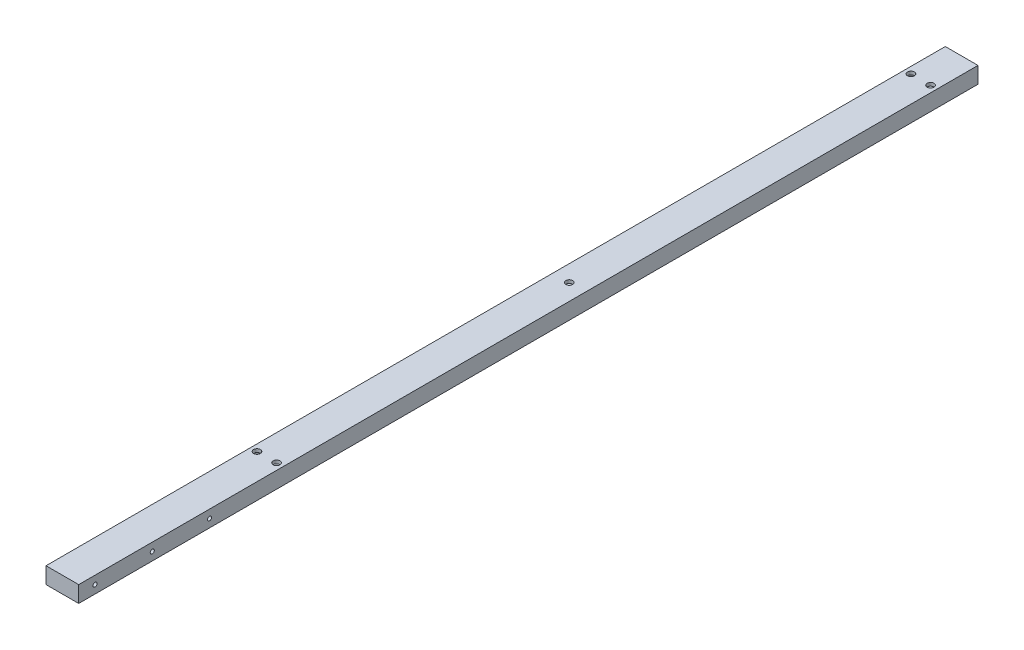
ISO-10303-21;
HEADER;
FILE_DESCRIPTION(('STEP AP214'),'2;1');
FILE_NAME('part.step','',(''),(''),'','','');
FILE_SCHEMA(('AUTOMOTIVE_DESIGN { 1 0 10303 214 1 1 1 1 }'));
ENDSEC;
DATA;
#1=APPLICATION_CONTEXT('core data for automotive mechanical design processes');
#2=APPLICATION_PROTOCOL_DEFINITION('international standard','automotive_design',2000,#1);
#3=PRODUCT_CONTEXT('',#1,'mechanical');
#4=PRODUCT('Part','Part','',(#3));
#5=PRODUCT_RELATED_PRODUCT_CATEGORY('part','',(#4));
#6=PRODUCT_DEFINITION_FORMATION('','',#4);
#7=PRODUCT_DEFINITION_CONTEXT('part definition',#1,'design');
#8=PRODUCT_DEFINITION('design','',#6,#7);
#9=PRODUCT_DEFINITION_SHAPE('','',#8);
#10=(LENGTH_UNIT() NAMED_UNIT(*) SI_UNIT(.MILLI.,.METRE.));
#11=(NAMED_UNIT(*) PLANE_ANGLE_UNIT() SI_UNIT($,.RADIAN.));
#12=(NAMED_UNIT(*) SI_UNIT($,.STERADIAN.) SOLID_ANGLE_UNIT());
#13=UNCERTAINTY_MEASURE_WITH_UNIT(LENGTH_MEASURE(1.E-05),#10,'distance_accuracy_value','');
#14=(GEOMETRIC_REPRESENTATION_CONTEXT(3) GLOBAL_UNCERTAINTY_ASSIGNED_CONTEXT((#13)) GLOBAL_UNIT_ASSIGNED_CONTEXT((#10,
#11,#12)) REPRESENTATION_CONTEXT('',''));
#15=CARTESIAN_POINT('',(0.,0.,0.));
#16=DIRECTION('',(0.,0.,1.));
#17=DIRECTION('',(1.,0.,0.));
#18=AXIS2_PLACEMENT_3D('',#15,#16,#17);
#19=CARTESIAN_POINT('',(-8.,3.,450.));
#20=DIRECTION('',(1.,0.,0.));
#21=DIRECTION('',(0.,0.,-1.));
#22=AXIS2_PLACEMENT_3D('',#19,#20,#21);
#23=PLANE('',#22);
#24=DIRECTION('',(0.,1.,0.));
#25=VECTOR('',#24,1.);
#26=CARTESIAN_POINT('',(-8.,5.,424.359687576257));
#27=LINE('',#26,#25);
#28=CARTESIAN_POINT('',(-8.,-3.,424.359687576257));
#29=VERTEX_POINT('',#28);
#30=CARTESIAN_POINT('',(-8.,3.,424.359687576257));
#31=VERTEX_POINT('',#30);
#32=EDGE_CURVE('E198',#29,#31,#27,.T.);
#33=ORIENTED_EDGE('',*,*,#32,.F.);
#34=DIRECTION('',(0.,0.,-1.));
#35=VECTOR('',#34,1.);
#36=CARTESIAN_POINT('',(-8.,-3.,450.));
#37=LINE('',#36,#35);
#38=CARTESIAN_POINT('',(-8.,-3.,25.6403124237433));
#39=VERTEX_POINT('',#38);
#40=EDGE_CURVE('E274',#29,#39,#37,.T.);
#41=ORIENTED_EDGE('',*,*,#40,.T.);
#42=DIRECTION('',(0.,1.,0.));
#43=VECTOR('',#42,1.);
#44=CARTESIAN_POINT('',(-8.,5.,25.6403124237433));
#45=LINE('',#44,#43);
#46=CARTESIAN_POINT('',(-8.,3.,25.6403124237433));
#47=VERTEX_POINT('',#46);
#48=EDGE_CURVE('E219',#47,#39,#45,.F.);
#49=ORIENTED_EDGE('',*,*,#48,.F.);
#50=DIRECTION('',(0.,0.,-1.));
#51=VECTOR('',#50,1.);
#52=CARTESIAN_POINT('',(-8.,3.,450.));
#53=LINE('',#52,#51);
#54=EDGE_CURVE('E279',#31,#47,#53,.T.);
#55=ORIENTED_EDGE('',*,*,#54,.F.);
#56=EDGE_LOOP('',(#33,#41,#49,#55));
#57=FACE_BOUND('',#56,.T.);
#58=ADVANCED_FACE('F35',(#57),#23,.T.);
#59=CARTESIAN_POINT('',(8.,3.,450.));
#60=DIRECTION('',(-1.,0.,0.));
#61=DIRECTION('',(0.,0.,1.));
#62=AXIS2_PLACEMENT_3D('',#59,#60,#61);
#63=PLANE('',#62);
#64=DIRECTION('',(0.,1.,0.));
#65=VECTOR('',#64,1.);
#66=CARTESIAN_POINT('',(8.,5.,425.640312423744));
#67=LINE('',#66,#65);
#68=CARTESIAN_POINT('',(8.,-3.,425.640312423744));
#69=VERTEX_POINT('',#68);
#70=CARTESIAN_POINT('',(8.,3.,425.640312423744));
#71=VERTEX_POINT('',#70);
#72=EDGE_CURVE('E209',#69,#71,#67,.T.);
#73=ORIENTED_EDGE('',*,*,#72,.F.);
#74=DIRECTION('',(0.,0.,-1.));
#75=VECTOR('',#74,1.);
#76=CARTESIAN_POINT('',(8.,-3.,450.));
#77=LINE('',#76,#75);
#78=CARTESIAN_POINT('',(8.,-3.,450.));
#79=VERTEX_POINT('',#78);
#80=EDGE_CURVE('E265',#79,#69,#77,.T.);
#81=ORIENTED_EDGE('',*,*,#80,.F.);
#82=DIRECTION('',(0.,1.,0.));
#83=VECTOR('',#82,1.);
#84=CARTESIAN_POINT('',(8.,3.,450.));
#85=LINE('',#84,#83);
#86=CARTESIAN_POINT('',(8.,3.,450.));
#87=VERTEX_POINT('',#86);
#88=EDGE_CURVE('E241',#79,#87,#85,.T.);
#89=ORIENTED_EDGE('',*,*,#88,.T.);
#90=DIRECTION('',(0.,0.,-1.));
#91=VECTOR('',#90,1.);
#92=CARTESIAN_POINT('',(8.,3.,450.));
#93=LINE('',#92,#91);
#94=EDGE_CURVE('E280',#87,#71,#93,.T.);
#95=ORIENTED_EDGE('',*,*,#94,.T.);
#96=EDGE_LOOP('',(#73,#81,#89,#95));
#97=FACE_BOUND('',#96,.T.);
#98=ADVANCED_FACE('F310',(#97),#63,.T.);
#99=DIRECTION('',(0.,1.,0.));
#100=VECTOR('',#99,1.);
#101=CARTESIAN_POINT('',(-8.,5.,24.3596875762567));
#102=LINE('',#101,#100);
#103=CARTESIAN_POINT('',(-8.,-3.,24.3596875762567));
#104=VERTEX_POINT('',#103);
#105=CARTESIAN_POINT('',(-8.,3.,24.3596875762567));
#106=VERTEX_POINT('',#105);
#107=EDGE_CURVE('E222',#104,#106,#102,.T.);
#108=ORIENTED_EDGE('',*,*,#107,.F.);
#109=CARTESIAN_POINT('',(-8.,-3.,0.));
#110=VERTEX_POINT('',#109);
#111=EDGE_CURVE('E268',#104,#110,#37,.T.);
#112=ORIENTED_EDGE('',*,*,#111,.T.);
#113=DIRECTION('',(0.,-1.,0.));
#114=VECTOR('',#113,1.);
#115=CARTESIAN_POINT('',(-8.,3.,0.));
#116=LINE('',#115,#114);
#117=CARTESIAN_POINT('',(-8.,3.,0.));
#118=VERTEX_POINT('',#117);
#119=EDGE_CURVE('E260',#118,#110,#116,.T.);
#120=ORIENTED_EDGE('',*,*,#119,.F.);
#121=EDGE_CURVE('E273',#106,#118,#53,.T.);
#122=ORIENTED_EDGE('',*,*,#121,.F.);
#123=EDGE_LOOP('',(#108,#112,#120,#122));
#124=FACE_BOUND('',#123,.T.);
#125=ADVANCED_FACE('F341',(#124),#23,.T.);
#126=DIRECTION('',(0.,1.,0.));
#127=VECTOR('',#126,1.);
#128=CARTESIAN_POINT('',(8.,5.,424.359687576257));
#129=LINE('',#128,#127);
#130=CARTESIAN_POINT('',(8.,3.,424.359687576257));
#131=VERTEX_POINT('',#130);
#132=CARTESIAN_POINT('',(8.,-3.,424.359687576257));
#133=VERTEX_POINT('',#132);
#134=EDGE_CURVE('E58',#131,#133,#129,.F.);
#135=ORIENTED_EDGE('',*,*,#134,.F.);
#136=CARTESIAN_POINT('',(8.,3.,25.6403124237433));
#137=VERTEX_POINT('',#136);
#138=EDGE_CURVE('E284',#131,#137,#93,.T.);
#139=ORIENTED_EDGE('',*,*,#138,.T.);
#140=DIRECTION('',(0.,1.,0.));
#141=VECTOR('',#140,1.);
#142=CARTESIAN_POINT('',(8.,5.,25.6403124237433));
#143=LINE('',#142,#141);
#144=CARTESIAN_POINT('',(8.,-3.,25.6403124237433));
#145=VERTEX_POINT('',#144);
#146=EDGE_CURVE('E237',#145,#137,#143,.T.);
#147=ORIENTED_EDGE('',*,*,#146,.F.);
#148=EDGE_CURVE('E269',#133,#145,#77,.T.);
#149=ORIENTED_EDGE('',*,*,#148,.F.);
#150=EDGE_LOOP('',(#135,#139,#147,#149));
#151=FACE_BOUND('',#150,.T.);
#152=ADVANCED_FACE('F323',(#151),#63,.T.);
#153=CARTESIAN_POINT('',(0.,0.,0.));
#154=DIRECTION('',(0.,0.,1.));
#155=DIRECTION('',(1.,0.,0.));
#156=AXIS2_PLACEMENT_3D('',#153,#154,#155);
#157=PLANE('',#156);
#158=DIRECTION('',(0.,1.,0.));
#159=VECTOR('',#158,1.);
#160=CARTESIAN_POINT('',(10.,5.,0.));
#161=LINE('',#160,#159);
#162=CARTESIAN_POINT('',(10.,-5.,0.));
#163=VERTEX_POINT('',#162);
#164=CARTESIAN_POINT('',(10.,5.,0.));
#165=VERTEX_POINT('',#164);
#166=EDGE_CURVE('E283',#163,#165,#161,.T.);
#167=ORIENTED_EDGE('',*,*,#166,.F.);
#168=DIRECTION('',(1.,0.,0.));
#169=VECTOR('',#168,1.);
#170=CARTESIAN_POINT('',(-10.,-5.,0.));
#171=LINE('',#170,#169);
#172=CARTESIAN_POINT('',(-10.,-5.,0.));
#173=VERTEX_POINT('',#172);
#174=EDGE_CURVE('E290',#173,#163,#171,.T.);
#175=ORIENTED_EDGE('',*,*,#174,.F.);
#176=DIRECTION('',(0.,-1.,0.));
#177=VECTOR('',#176,1.);
#178=CARTESIAN_POINT('',(-10.,5.,0.));
#179=LINE('',#178,#177);
#180=CARTESIAN_POINT('',(-10.,5.,0.));
#181=VERTEX_POINT('',#180);
#182=EDGE_CURVE('E288',#181,#173,#179,.T.);
#183=ORIENTED_EDGE('',*,*,#182,.F.);
#184=DIRECTION('',(-1.,0.,0.));
#185=VECTOR('',#184,1.);
#186=CARTESIAN_POINT('',(-10.,5.,0.));
#187=LINE('',#186,#185);
#188=EDGE_CURVE('E153',#165,#181,#187,.T.);
#189=ORIENTED_EDGE('',*,*,#188,.F.);
#190=EDGE_LOOP('',(#167,#175,#183,#189));
#191=FACE_BOUND('',#190,.T.);
#192=DIRECTION('',(0.,1.,0.));
#193=VECTOR('',#192,1.);
#194=CARTESIAN_POINT('',(8.,3.,0.));
#195=LINE('',#194,#193);
#196=CARTESIAN_POINT('',(8.,-3.,0.));
#197=VERTEX_POINT('',#196);
#198=CARTESIAN_POINT('',(8.,3.,0.));
#199=VERTEX_POINT('',#198);
#200=EDGE_CURVE('E240',#197,#199,#195,.T.);
#201=ORIENTED_EDGE('',*,*,#200,.T.);
#202=DIRECTION('',(-1.,0.,0.));
#203=VECTOR('',#202,1.);
#204=CARTESIAN_POINT('',(-8.,3.,0.));
#205=LINE('',#204,#203);
#206=EDGE_CURVE('E257',#199,#118,#205,.T.);
#207=ORIENTED_EDGE('',*,*,#206,.T.);
#208=ORIENTED_EDGE('',*,*,#119,.T.);
#209=DIRECTION('',(1.,0.,0.));
#210=VECTOR('',#209,1.);
#211=CARTESIAN_POINT('',(-8.,-3.,0.));
#212=LINE('',#211,#210);
#213=EDGE_CURVE('E245',#110,#197,#212,.T.);
#214=ORIENTED_EDGE('',*,*,#213,.T.);
#215=EDGE_LOOP('',(#201,#207,#208,#214));
#216=FACE_BOUND('',#215,.T.);
#217=ADVANCED_FACE('F336',(#191,#216),#157,.F.);
#218=CARTESIAN_POINT('',(10.,5.,450.));
#219=DIRECTION('',(-1.,0.,0.));
#220=DIRECTION('',(0.,-1.,0.));
#221=AXIS2_PLACEMENT_3D('',#218,#219,#220);
#222=PLANE('',#221);
#223=CARTESIAN_POINT('',(10.,0.,540.));
#224=DIRECTION('',(-1.,0.,0.));
#225=DIRECTION('',(0.,0.,1.));
#226=AXIS2_PLACEMENT_3D('',#223,#224,#225);
#227=CIRCLE('',#226,1.25);
#228=CARTESIAN_POINT('',(10.,0.,541.25));
#229=VERTEX_POINT('',#228);
#230=EDGE_CURVE('E447',#229,#229,#227,.T.);
#231=ORIENTED_EDGE('',*,*,#230,.T.);
#232=EDGE_LOOP('',(#231));
#233=FACE_BOUND('',#232,.T.);
#234=CARTESIAN_POINT('',(10.,0.,505.));
#235=DIRECTION('',(-1.,0.,0.));
#236=DIRECTION('',(0.,0.,1.));
#237=AXIS2_PLACEMENT_3D('',#234,#235,#236);
#238=CIRCLE('',#237,1.25);
#239=CARTESIAN_POINT('',(10.,0.,506.25));
#240=VERTEX_POINT('',#239);
#241=EDGE_CURVE('E457',#240,#240,#238,.T.);
#242=ORIENTED_EDGE('',*,*,#241,.T.);
#243=EDGE_LOOP('',(#242));
#244=FACE_BOUND('',#243,.T.);
#245=CARTESIAN_POINT('',(10.,0.,470.));
#246=DIRECTION('',(-1.,0.,0.));
#247=DIRECTION('',(0.,0.,1.));
#248=AXIS2_PLACEMENT_3D('',#245,#246,#247);
#249=CIRCLE('',#248,1.25);
#250=CARTESIAN_POINT('',(10.,0.,471.25));
#251=VERTEX_POINT('',#250);
#252=EDGE_CURVE('E172',#251,#251,#249,.T.);
#253=ORIENTED_EDGE('',*,*,#252,.T.);
#254=EDGE_LOOP('',(#253));
#255=FACE_BOUND('',#254,.T.);
#256=ORIENTED_EDGE('',*,*,#166,.T.);
#257=DIRECTION('',(0.,0.,-1.));
#258=VECTOR('',#257,1.);
#259=CARTESIAN_POINT('',(10.,5.,450.));
#260=LINE('',#259,#258);
#261=CARTESIAN_POINT('',(10.,5.,550.));
#262=VERTEX_POINT('',#261);
#263=EDGE_CURVE('E157',#262,#165,#260,.T.);
#264=ORIENTED_EDGE('',*,*,#263,.F.);
#265=DIRECTION('',(0.,-1.,0.));
#266=VECTOR('',#265,1.);
#267=CARTESIAN_POINT('',(10.,5.,550.));
#268=LINE('',#267,#266);
#269=CARTESIAN_POINT('',(10.,-5.,550.));
#270=VERTEX_POINT('',#269);
#271=EDGE_CURVE('E168',#262,#270,#268,.T.);
#272=ORIENTED_EDGE('',*,*,#271,.T.);
#273=DIRECTION('',(0.,0.,-1.));
#274=VECTOR('',#273,1.);
#275=CARTESIAN_POINT('',(10.,-5.,450.));
#276=LINE('',#275,#274);
#277=EDGE_CURVE('E292',#270,#163,#276,.T.);
#278=ORIENTED_EDGE('',*,*,#277,.T.);
#279=EDGE_LOOP('',(#256,#264,#272,#278));
#280=FACE_BOUND('',#279,.T.);
#281=ADVANCED_FACE('F37',(#233,#244,#255,#280),#222,.F.);
#282=CARTESIAN_POINT('',(-10.,5.,450.));
#283=DIRECTION('',(0.,-1.,0.));
#284=DIRECTION('',(0.,0.,-1.));
#285=AXIS2_PLACEMENT_3D('',#282,#283,#284);
#286=PLANE('',#285);
#287=CARTESIAN_POINT('',(0.,5.,240.));
#288=DIRECTION('',(0.,-1.,0.));
#289=DIRECTION('',(0.,0.,-1.));
#290=AXIS2_PLACEMENT_3D('',#287,#288,#289);
#291=CIRCLE('',#290,2.1);
#292=CARTESIAN_POINT('',(0.,5.,237.9));
#293=VERTEX_POINT('',#292);
#294=EDGE_CURVE('E185',#293,#293,#291,.T.);
#295=ORIENTED_EDGE('',*,*,#294,.T.);
#296=EDGE_LOOP('',(#295));
#297=FACE_BOUND('',#296,.T.);
#298=CARTESIAN_POINT('',(-5.99999999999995,5.,425.));
#299=DIRECTION('',(0.,1.,0.));
#300=DIRECTION('',(0.,0.,1.));
#301=AXIS2_PLACEMENT_3D('',#298,#299,#300);
#302=CIRCLE('',#301,2.1);
#303=CARTESIAN_POINT('',(-5.99999999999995,5.,427.1));
#304=VERTEX_POINT('',#303);
#305=EDGE_CURVE('E191',#304,#304,#302,.T.);
#306=ORIENTED_EDGE('',*,*,#305,.F.);
#307=EDGE_LOOP('',(#306));
#308=FACE_BOUND('',#307,.T.);
#309=CARTESIAN_POINT('',(6.00000000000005,5.,425.));
#310=DIRECTION('',(0.,1.,0.));
#311=DIRECTION('',(0.,0.,1.));
#312=AXIS2_PLACEMENT_3D('',#309,#310,#311);
#313=CIRCLE('',#312,2.1);
#314=CARTESIAN_POINT('',(6.00000000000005,5.,427.1));
#315=VERTEX_POINT('',#314);
#316=EDGE_CURVE('E202',#315,#315,#313,.T.);
#317=ORIENTED_EDGE('',*,*,#316,.F.);
#318=EDGE_LOOP('',(#317));
#319=FACE_BOUND('',#318,.T.);
#320=CARTESIAN_POINT('',(-6.,5.,25.));
#321=DIRECTION('',(0.,1.,0.));
#322=DIRECTION('',(0.,0.,1.));
#323=AXIS2_PLACEMENT_3D('',#320,#321,#322);
#324=CIRCLE('',#323,2.1);
#325=CARTESIAN_POINT('',(-6.,5.,27.1));
#326=VERTEX_POINT('',#325);
#327=EDGE_CURVE('E213',#326,#326,#324,.T.);
#328=ORIENTED_EDGE('',*,*,#327,.F.);
#329=EDGE_LOOP('',(#328));
#330=FACE_BOUND('',#329,.T.);
#331=CARTESIAN_POINT('',(6.,5.,25.));
#332=DIRECTION('',(0.,1.,0.));
#333=DIRECTION('',(0.,0.,1.));
#334=AXIS2_PLACEMENT_3D('',#331,#332,#333);
#335=CIRCLE('',#334,2.1);
#336=CARTESIAN_POINT('',(6.,5.,27.1));
#337=VERTEX_POINT('',#336);
#338=EDGE_CURVE('E227',#337,#337,#335,.T.);
#339=ORIENTED_EDGE('',*,*,#338,.F.);
#340=EDGE_LOOP('',(#339));
#341=FACE_BOUND('',#340,.T.);
#342=ORIENTED_EDGE('',*,*,#188,.T.);
#343=DIRECTION('',(0.,0.,-1.));
#344=VECTOR('',#343,1.);
#345=CARTESIAN_POINT('',(-10.,5.,450.));
#346=LINE('',#345,#344);
#347=CARTESIAN_POINT('',(-10.,5.,550.));
#348=VERTEX_POINT('',#347);
#349=EDGE_CURVE('E148',#348,#181,#346,.T.);
#350=ORIENTED_EDGE('',*,*,#349,.F.);
#351=DIRECTION('',(1.,0.,0.));
#352=VECTOR('',#351,1.);
#353=CARTESIAN_POINT('',(10.,5.,550.));
#354=LINE('',#353,#352);
#355=EDGE_CURVE('E152',#348,#262,#354,.T.);
#356=ORIENTED_EDGE('',*,*,#355,.T.);
#357=ORIENTED_EDGE('',*,*,#263,.T.);
#358=EDGE_LOOP('',(#342,#350,#356,#357));
#359=FACE_BOUND('',#358,.T.);
#360=ADVANCED_FACE('F150',(#297,#308,#319,#330,#341,#359),#286,.F.);
#361=CARTESIAN_POINT('',(-10.,5.,450.));
#362=DIRECTION('',(1.,0.,0.));
#363=DIRECTION('',(0.,0.,-1.));
#364=AXIS2_PLACEMENT_3D('',#361,#362,#363);
#365=PLANE('',#364);
#366=CARTESIAN_POINT('',(-10.,0.,540.));
#367=DIRECTION('',(-1.,0.,0.));
#368=DIRECTION('',(0.,0.,1.));
#369=AXIS2_PLACEMENT_3D('',#366,#367,#368);
#370=CIRCLE('',#369,1.24999999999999);
#371=CARTESIAN_POINT('',(-10.,0.,541.25));
#372=VERTEX_POINT('',#371);
#373=EDGE_CURVE('E450',#372,#372,#370,.T.);
#374=ORIENTED_EDGE('',*,*,#373,.F.);
#375=EDGE_LOOP('',(#374));
#376=FACE_BOUND('',#375,.T.);
#377=CARTESIAN_POINT('',(-10.,0.,505.));
#378=DIRECTION('',(-1.,0.,0.));
#379=DIRECTION('',(0.,0.,1.));
#380=AXIS2_PLACEMENT_3D('',#377,#378,#379);
#381=CIRCLE('',#380,1.24999999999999);
#382=CARTESIAN_POINT('',(-10.,0.,506.25));
#383=VERTEX_POINT('',#382);
#384=EDGE_CURVE('E452',#383,#383,#381,.T.);
#385=ORIENTED_EDGE('',*,*,#384,.F.);
#386=EDGE_LOOP('',(#385));
#387=FACE_BOUND('',#386,.T.);
#388=CARTESIAN_POINT('',(-10.,0.,470.));
#389=DIRECTION('',(-1.,0.,0.));
#390=DIRECTION('',(0.,0.,1.));
#391=AXIS2_PLACEMENT_3D('',#388,#389,#390);
#392=CIRCLE('',#391,1.24999999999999);
#393=CARTESIAN_POINT('',(-10.,0.,471.25));
#394=VERTEX_POINT('',#393);
#395=EDGE_CURVE('E175',#394,#394,#392,.T.);
#396=ORIENTED_EDGE('',*,*,#395,.F.);
#397=EDGE_LOOP('',(#396));
#398=FACE_BOUND('',#397,.T.);
#399=ORIENTED_EDGE('',*,*,#182,.T.);
#400=DIRECTION('',(0.,0.,-1.));
#401=VECTOR('',#400,1.);
#402=CARTESIAN_POINT('',(-10.,-5.,450.));
#403=LINE('',#402,#401);
#404=CARTESIAN_POINT('',(-10.,-5.,550.));
#405=VERTEX_POINT('',#404);
#406=EDGE_CURVE('E158',#405,#173,#403,.T.);
#407=ORIENTED_EDGE('',*,*,#406,.F.);
#408=DIRECTION('',(0.,1.,0.));
#409=VECTOR('',#408,1.);
#410=CARTESIAN_POINT('',(-10.,5.,550.));
#411=LINE('',#410,#409);
#412=EDGE_CURVE('E165',#405,#348,#411,.T.);
#413=ORIENTED_EDGE('',*,*,#412,.T.);
#414=ORIENTED_EDGE('',*,*,#349,.T.);
#415=EDGE_LOOP('',(#399,#407,#413,#414));
#416=FACE_BOUND('',#415,.T.);
#417=ADVANCED_FACE('F170',(#376,#387,#398,#416),#365,.F.);
#418=CARTESIAN_POINT('',(-10.,-5.,450.));
#419=DIRECTION('',(0.,1.,0.));
#420=DIRECTION('',(0.,0.,1.));
#421=AXIS2_PLACEMENT_3D('',#418,#419,#420);
#422=PLANE('',#421);
#423=CARTESIAN_POINT('',(0.,-5.,240.));
#424=DIRECTION('',(0.,-1.,0.));
#425=DIRECTION('',(0.,0.,-1.));
#426=AXIS2_PLACEMENT_3D('',#423,#424,#425);
#427=CIRCLE('',#426,2.09999999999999);
#428=CARTESIAN_POINT('',(0.,-5.,237.9));
#429=VERTEX_POINT('',#428);
#430=EDGE_CURVE('E182',#429,#429,#427,.T.);
#431=ORIENTED_EDGE('',*,*,#430,.F.);
#432=EDGE_LOOP('',(#431));
#433=FACE_BOUND('',#432,.T.);
#434=CARTESIAN_POINT('',(-5.99999999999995,-5.,425.));
#435=DIRECTION('',(0.,1.,0.));
#436=DIRECTION('',(0.,0.,1.));
#437=AXIS2_PLACEMENT_3D('',#434,#435,#436);
#438=CIRCLE('',#437,2.1);
#439=CARTESIAN_POINT('',(-5.99999999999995,-5.,427.1));
#440=VERTEX_POINT('',#439);
#441=EDGE_CURVE('E194',#440,#440,#438,.T.);
#442=ORIENTED_EDGE('',*,*,#441,.T.);
#443=EDGE_LOOP('',(#442));
#444=FACE_BOUND('',#443,.T.);
#445=CARTESIAN_POINT('',(6.00000000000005,-5.,425.));
#446=DIRECTION('',(0.,1.,0.));
#447=DIRECTION('',(0.,0.,1.));
#448=AXIS2_PLACEMENT_3D('',#445,#446,#447);
#449=CIRCLE('',#448,2.1);
#450=CARTESIAN_POINT('',(6.00000000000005,-5.,427.1));
#451=VERTEX_POINT('',#450);
#452=EDGE_CURVE('E205',#451,#451,#449,.T.);
#453=ORIENTED_EDGE('',*,*,#452,.T.);
#454=EDGE_LOOP('',(#453));
#455=FACE_BOUND('',#454,.T.);
#456=CARTESIAN_POINT('',(-6.,-5.,25.));
#457=DIRECTION('',(0.,1.,0.));
#458=DIRECTION('',(0.,0.,1.));
#459=AXIS2_PLACEMENT_3D('',#456,#457,#458);
#460=CIRCLE('',#459,2.1);
#461=CARTESIAN_POINT('',(-6.,-5.,27.1));
#462=VERTEX_POINT('',#461);
#463=EDGE_CURVE('E216',#462,#462,#460,.T.);
#464=ORIENTED_EDGE('',*,*,#463,.T.);
#465=EDGE_LOOP('',(#464));
#466=FACE_BOUND('',#465,.T.);
#467=CARTESIAN_POINT('',(6.,-5.,25.));
#468=DIRECTION('',(0.,1.,0.));
#469=DIRECTION('',(0.,0.,1.));
#470=AXIS2_PLACEMENT_3D('',#467,#468,#469);
#471=CIRCLE('',#470,2.1);
#472=CARTESIAN_POINT('',(6.,-5.,27.1));
#473=VERTEX_POINT('',#472);
#474=EDGE_CURVE('E230',#473,#473,#471,.T.);
#475=ORIENTED_EDGE('',*,*,#474,.T.);
#476=EDGE_LOOP('',(#475));
#477=FACE_BOUND('',#476,.T.);
#478=ORIENTED_EDGE('',*,*,#174,.T.);
#479=ORIENTED_EDGE('',*,*,#277,.F.);
#480=DIRECTION('',(-1.,0.,0.));
#481=VECTOR('',#480,1.);
#482=CARTESIAN_POINT('',(10.,-5.,550.));
#483=LINE('',#482,#481);
#484=EDGE_CURVE('E180',#270,#405,#483,.T.);
#485=ORIENTED_EDGE('',*,*,#484,.T.);
#486=ORIENTED_EDGE('',*,*,#406,.T.);
#487=EDGE_LOOP('',(#478,#479,#485,#486));
#488=FACE_BOUND('',#487,.T.);
#489=ADVANCED_FACE('F380',(#433,#444,#455,#466,#477,#488),#422,.F.);
#490=DIRECTION('',(0.,1.,0.));
#491=VECTOR('',#490,1.);
#492=CARTESIAN_POINT('',(8.,5.,24.3596875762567));
#493=LINE('',#492,#491);
#494=CARTESIAN_POINT('',(8.,3.,24.3596875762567));
#495=VERTEX_POINT('',#494);
#496=CARTESIAN_POINT('',(8.,-3.,24.3596875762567));
#497=VERTEX_POINT('',#496);
#498=EDGE_CURVE('E233',#495,#497,#493,.F.);
#499=ORIENTED_EDGE('',*,*,#498,.F.);
#500=EDGE_CURVE('E278',#495,#199,#93,.T.);
#501=ORIENTED_EDGE('',*,*,#500,.T.);
#502=ORIENTED_EDGE('',*,*,#200,.F.);
#503=EDGE_CURVE('E254',#497,#197,#77,.T.);
#504=ORIENTED_EDGE('',*,*,#503,.F.);
#505=EDGE_LOOP('',(#499,#501,#502,#504));
#506=FACE_BOUND('',#505,.T.);
#507=ADVANCED_FACE('F332',(#506),#63,.T.);
#508=CARTESIAN_POINT('',(-8.,3.,450.));
#509=DIRECTION('',(0.,-1.,0.));
#510=DIRECTION('',(0.,0.,-1.));
#511=AXIS2_PLACEMENT_3D('',#508,#509,#510);
#512=PLANE('',#511);
#513=CARTESIAN_POINT('',(0.,3.,240.));
#514=DIRECTION('',(0.,-1.,0.));
#515=DIRECTION('',(0.,0.,-1.));
#516=AXIS2_PLACEMENT_3D('',#513,#514,#515);
#517=CIRCLE('',#516,2.09999999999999);
#518=CARTESIAN_POINT('',(0.,3.,237.9));
#519=VERTEX_POINT('',#518);
#520=EDGE_CURVE('E188',#519,#519,#517,.T.);
#521=ORIENTED_EDGE('',*,*,#520,.F.);
#522=EDGE_LOOP('',(#521));
#523=FACE_BOUND('',#522,.T.);
#524=CARTESIAN_POINT('',(-5.99999999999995,3.,425.));
#525=DIRECTION('',(0.,-1.,0.));
#526=DIRECTION('',(0.,0.,-1.));
#527=AXIS2_PLACEMENT_3D('',#524,#525,#526);
#528=CIRCLE('',#527,2.1);
#529=CARTESIAN_POINT('',(-8.,3.,425.640312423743));
#530=VERTEX_POINT('',#529);
#531=EDGE_CURVE('E200',#31,#530,#528,.T.);
#532=ORIENTED_EDGE('',*,*,#531,.F.);
#533=ORIENTED_EDGE('',*,*,#54,.T.);
#534=CARTESIAN_POINT('',(-6.,3.,25.));
#535=DIRECTION('',(0.,-1.,0.));
#536=DIRECTION('',(0.,0.,-1.));
#537=AXIS2_PLACEMENT_3D('',#534,#535,#536);
#538=CIRCLE('',#537,2.1);
#539=EDGE_CURVE('E224',#106,#47,#538,.T.);
#540=ORIENTED_EDGE('',*,*,#539,.F.);
#541=ORIENTED_EDGE('',*,*,#121,.T.);
#542=ORIENTED_EDGE('',*,*,#206,.F.);
#543=ORIENTED_EDGE('',*,*,#500,.F.);
#544=CARTESIAN_POINT('',(6.,3.,25.));
#545=DIRECTION('',(0.,-1.,0.));
#546=DIRECTION('',(0.,0.,-1.));
#547=AXIS2_PLACEMENT_3D('',#544,#545,#546);
#548=CIRCLE('',#547,2.1);
#549=EDGE_CURVE('E235',#137,#495,#548,.T.);
#550=ORIENTED_EDGE('',*,*,#549,.F.);
#551=ORIENTED_EDGE('',*,*,#138,.F.);
#552=CARTESIAN_POINT('',(6.00000000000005,3.,425.));
#553=DIRECTION('',(0.,-1.,0.));
#554=DIRECTION('',(0.,0.,-1.));
#555=AXIS2_PLACEMENT_3D('',#552,#553,#554);
#556=CIRCLE('',#555,2.1);
#557=EDGE_CURVE('E211',#71,#131,#556,.T.);
#558=ORIENTED_EDGE('',*,*,#557,.F.);
#559=ORIENTED_EDGE('',*,*,#94,.F.);
#560=DIRECTION('',(-1.,0.,0.));
#561=VECTOR('',#560,1.);
#562=CARTESIAN_POINT('',(-8.,3.,450.));
#563=LINE('',#562,#561);
#564=CARTESIAN_POINT('',(-8.,3.,450.));
#565=VERTEX_POINT('',#564);
#566=EDGE_CURVE('E244',#87,#565,#563,.T.);
#567=ORIENTED_EDGE('',*,*,#566,.T.);
#568=EDGE_CURVE('E275',#565,#530,#53,.T.);
#569=ORIENTED_EDGE('',*,*,#568,.T.);
#570=EDGE_LOOP('',(#532,#533,#540,#541,#542,#543,#550,#551,#558,#559,#567,#569));
#571=FACE_BOUND('',#570,.T.);
#572=ADVANCED_FACE('F318',(#523,#571),#512,.T.);
#573=DIRECTION('',(0.,1.,0.));
#574=VECTOR('',#573,1.);
#575=CARTESIAN_POINT('',(-8.,5.,425.640312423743));
#576=LINE('',#575,#574);
#577=CARTESIAN_POINT('',(-8.,-3.,425.640312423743));
#578=VERTEX_POINT('',#577);
#579=EDGE_CURVE('E50',#530,#578,#576,.F.);
#580=ORIENTED_EDGE('',*,*,#579,.F.);
#581=ORIENTED_EDGE('',*,*,#568,.F.);
#582=DIRECTION('',(0.,-1.,0.));
#583=VECTOR('',#582,1.);
#584=CARTESIAN_POINT('',(-8.,3.,450.));
#585=LINE('',#584,#583);
#586=CARTESIAN_POINT('',(-8.,-3.,450.));
#587=VERTEX_POINT('',#586);
#588=EDGE_CURVE('E248',#565,#587,#585,.T.);
#589=ORIENTED_EDGE('',*,*,#588,.T.);
#590=EDGE_CURVE('E270',#587,#578,#37,.T.);
#591=ORIENTED_EDGE('',*,*,#590,.T.);
#592=EDGE_LOOP('',(#580,#581,#589,#591));
#593=FACE_BOUND('',#592,.T.);
#594=ADVANCED_FACE('F355',(#593),#23,.T.);
#595=CARTESIAN_POINT('',(-8.,-3.,450.));
#596=DIRECTION('',(0.,1.,0.));
#597=DIRECTION('',(0.,0.,1.));
#598=AXIS2_PLACEMENT_3D('',#595,#596,#597);
#599=PLANE('',#598);
#600=CARTESIAN_POINT('',(0.,-3.,240.));
#601=DIRECTION('',(0.,1.,0.));
#602=DIRECTION('',(0.,0.,1.));
#603=AXIS2_PLACEMENT_3D('',#600,#601,#602);
#604=CIRCLE('',#603,2.09999999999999);
#605=CARTESIAN_POINT('',(0.,-3.,242.1));
#606=VERTEX_POINT('',#605);
#607=EDGE_CURVE('E39',#606,#606,#604,.T.);
#608=ORIENTED_EDGE('',*,*,#607,.F.);
#609=EDGE_LOOP('',(#608));
#610=FACE_BOUND('',#609,.T.);
#611=CARTESIAN_POINT('',(-5.99999999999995,-3.,425.));
#612=DIRECTION('',(0.,1.,0.));
#613=DIRECTION('',(0.,0.,1.));
#614=AXIS2_PLACEMENT_3D('',#611,#612,#613);
#615=CIRCLE('',#614,2.1);
#616=EDGE_CURVE('E11',#578,#29,#615,.T.);
#617=ORIENTED_EDGE('',*,*,#616,.F.);
#618=ORIENTED_EDGE('',*,*,#590,.F.);
#619=DIRECTION('',(1.,0.,0.));
#620=VECTOR('',#619,1.);
#621=CARTESIAN_POINT('',(-8.,-3.,450.));
#622=LINE('',#621,#620);
#623=EDGE_CURVE('E251',#587,#79,#622,.T.);
#624=ORIENTED_EDGE('',*,*,#623,.T.);
#625=ORIENTED_EDGE('',*,*,#80,.T.);
#626=CARTESIAN_POINT('',(6.00000000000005,-3.,425.));
#627=DIRECTION('',(0.,1.,0.));
#628=DIRECTION('',(0.,0.,1.));
#629=AXIS2_PLACEMENT_3D('',#626,#627,#628);
#630=CIRCLE('',#629,2.1);
#631=EDGE_CURVE('E44',#133,#69,#630,.T.);
#632=ORIENTED_EDGE('',*,*,#631,.F.);
#633=ORIENTED_EDGE('',*,*,#148,.T.);
#634=CARTESIAN_POINT('',(6.,-3.,25.));
#635=DIRECTION('',(0.,1.,0.));
#636=DIRECTION('',(0.,0.,1.));
#637=AXIS2_PLACEMENT_3D('',#634,#635,#636);
#638=CIRCLE('',#637,2.1);
#639=EDGE_CURVE('E297',#497,#145,#638,.T.);
#640=ORIENTED_EDGE('',*,*,#639,.F.);
#641=ORIENTED_EDGE('',*,*,#503,.T.);
#642=ORIENTED_EDGE('',*,*,#213,.F.);
#643=ORIENTED_EDGE('',*,*,#111,.F.);
#644=CARTESIAN_POINT('',(-6.,-3.,25.));
#645=DIRECTION('',(0.,1.,0.));
#646=DIRECTION('',(0.,0.,1.));
#647=AXIS2_PLACEMENT_3D('',#644,#645,#646);
#648=CIRCLE('',#647,2.1);
#649=EDGE_CURVE('E300',#39,#104,#648,.T.);
#650=ORIENTED_EDGE('',*,*,#649,.F.);
#651=ORIENTED_EDGE('',*,*,#40,.F.);
#652=EDGE_LOOP('',(#617,#618,#624,#625,#632,#633,#640,#641,#642,#643,#650,#651));
#653=FACE_BOUND('',#652,.T.);
#654=ADVANCED_FACE('F312',(#610,#653),#599,.T.);
#655=CARTESIAN_POINT('',(6.,5.,25.));
#656=DIRECTION('',(0.,1.,0.));
#657=DIRECTION('',(0.,0.,1.));
#658=AXIS2_PLACEMENT_3D('',#655,#656,#657);
#659=CYLINDRICAL_SURFACE('',#658,2.1);
#660=ORIENTED_EDGE('',*,*,#146,.T.);
#661=ORIENTED_EDGE('',*,*,#549,.T.);
#662=ORIENTED_EDGE('',*,*,#498,.T.);
#663=ORIENTED_EDGE('',*,*,#639,.T.);
#664=EDGE_LOOP('',(#660,#661,#662,#663));
#665=FACE_BOUND('',#664,.T.);
#666=ORIENTED_EDGE('',*,*,#474,.F.);
#667=EDGE_LOOP('',(#666));
#668=FACE_BOUND('',#667,.T.);
#669=ORIENTED_EDGE('',*,*,#338,.T.);
#670=EDGE_LOOP('',(#669));
#671=FACE_BOUND('',#670,.T.);
#672=ADVANCED_FACE('F362',(#665,#668,#671),#659,.F.);
#673=CARTESIAN_POINT('',(-6.,5.,25.));
#674=DIRECTION('',(0.,1.,0.));
#675=DIRECTION('',(0.,0.,1.));
#676=AXIS2_PLACEMENT_3D('',#673,#674,#675);
#677=CYLINDRICAL_SURFACE('',#676,2.1);
#678=ORIENTED_EDGE('',*,*,#539,.T.);
#679=ORIENTED_EDGE('',*,*,#48,.T.);
#680=ORIENTED_EDGE('',*,*,#649,.T.);
#681=ORIENTED_EDGE('',*,*,#107,.T.);
#682=EDGE_LOOP('',(#678,#679,#680,#681));
#683=FACE_BOUND('',#682,.T.);
#684=ORIENTED_EDGE('',*,*,#463,.F.);
#685=EDGE_LOOP('',(#684));
#686=FACE_BOUND('',#685,.T.);
#687=ORIENTED_EDGE('',*,*,#327,.T.);
#688=EDGE_LOOP('',(#687));
#689=FACE_BOUND('',#688,.T.);
#690=ADVANCED_FACE('F349',(#683,#686,#689),#677,.F.);
#691=CARTESIAN_POINT('',(6.00000000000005,5.,425.));
#692=DIRECTION('',(0.,1.,0.));
#693=DIRECTION('',(0.,0.,1.));
#694=AXIS2_PLACEMENT_3D('',#691,#692,#693);
#695=CYLINDRICAL_SURFACE('',#694,2.1);
#696=ORIENTED_EDGE('',*,*,#557,.T.);
#697=ORIENTED_EDGE('',*,*,#134,.T.);
#698=ORIENTED_EDGE('',*,*,#631,.T.);
#699=ORIENTED_EDGE('',*,*,#72,.T.);
#700=EDGE_LOOP('',(#696,#697,#698,#699));
#701=FACE_BOUND('',#700,.T.);
#702=ORIENTED_EDGE('',*,*,#452,.F.);
#703=EDGE_LOOP('',(#702));
#704=FACE_BOUND('',#703,.T.);
#705=ORIENTED_EDGE('',*,*,#316,.T.);
#706=EDGE_LOOP('',(#705));
#707=FACE_BOUND('',#706,.T.);
#708=ADVANCED_FACE('F303',(#701,#704,#707),#695,.F.);
#709=CARTESIAN_POINT('',(-5.99999999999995,5.,425.));
#710=DIRECTION('',(0.,1.,0.));
#711=DIRECTION('',(0.,0.,1.));
#712=AXIS2_PLACEMENT_3D('',#709,#710,#711);
#713=CYLINDRICAL_SURFACE('',#712,2.1);
#714=ORIENTED_EDGE('',*,*,#531,.T.);
#715=ORIENTED_EDGE('',*,*,#579,.T.);
#716=ORIENTED_EDGE('',*,*,#616,.T.);
#717=ORIENTED_EDGE('',*,*,#32,.T.);
#718=EDGE_LOOP('',(#714,#715,#716,#717));
#719=FACE_BOUND('',#718,.T.);
#720=ORIENTED_EDGE('',*,*,#441,.F.);
#721=EDGE_LOOP('',(#720));
#722=FACE_BOUND('',#721,.T.);
#723=ORIENTED_EDGE('',*,*,#305,.T.);
#724=EDGE_LOOP('',(#723));
#725=FACE_BOUND('',#724,.T.);
#726=ADVANCED_FACE('F352',(#719,#722,#725),#713,.F.);
#727=CARTESIAN_POINT('',(0.,-5.,240.));
#728=DIRECTION('',(0.,-1.,0.));
#729=DIRECTION('',(0.,0.,-1.));
#730=AXIS2_PLACEMENT_3D('',#727,#728,#729);
#731=CYLINDRICAL_SURFACE('',#730,2.09999999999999);
#732=ORIENTED_EDGE('',*,*,#607,.T.);
#733=EDGE_LOOP('',(#732));
#734=FACE_BOUND('',#733,.T.);
#735=ORIENTED_EDGE('',*,*,#430,.T.);
#736=EDGE_LOOP('',(#735));
#737=FACE_BOUND('',#736,.T.);
#738=ADVANCED_FACE('F423',(#734,#737),#731,.F.);
#739=ORIENTED_EDGE('',*,*,#520,.T.);
#740=EDGE_LOOP('',(#739));
#741=FACE_BOUND('',#740,.T.);
#742=ORIENTED_EDGE('',*,*,#294,.F.);
#743=EDGE_LOOP('',(#742));
#744=FACE_BOUND('',#743,.T.);
#745=ADVANCED_FACE('F426',(#741,#744),#731,.F.);
#746=CARTESIAN_POINT('',(0.,0.,450.));
#747=DIRECTION('',(0.,0.,-1.));
#748=DIRECTION('',(-1.,0.,0.));
#749=AXIS2_PLACEMENT_3D('',#746,#747,#748);
#750=PLANE('',#749);
#751=ORIENTED_EDGE('',*,*,#566,.F.);
#752=ORIENTED_EDGE('',*,*,#88,.F.);
#753=ORIENTED_EDGE('',*,*,#623,.F.);
#754=ORIENTED_EDGE('',*,*,#588,.F.);
#755=EDGE_LOOP('',(#751,#752,#753,#754));
#756=FACE_BOUND('',#755,.T.);
#757=ADVANCED_FACE('F315',(#756),#750,.T.);
#758=CARTESIAN_POINT('',(0.,0.,550.));
#759=DIRECTION('',(0.,0.,-1.));
#760=DIRECTION('',(-1.,0.,0.));
#761=AXIS2_PLACEMENT_3D('',#758,#759,#760);
#762=PLANE('',#761);
#763=ORIENTED_EDGE('',*,*,#412,.F.);
#764=ORIENTED_EDGE('',*,*,#484,.F.);
#765=ORIENTED_EDGE('',*,*,#271,.F.);
#766=ORIENTED_EDGE('',*,*,#355,.F.);
#767=EDGE_LOOP('',(#763,#764,#765,#766));
#768=FACE_BOUND('',#767,.T.);
#769=ADVANCED_FACE('F163',(#768),#762,.F.);
#770=CARTESIAN_POINT('',(-10.,0.,470.));
#771=DIRECTION('',(-1.,0.,0.));
#772=DIRECTION('',(0.,0.,1.));
#773=AXIS2_PLACEMENT_3D('',#770,#771,#772);
#774=CYLINDRICAL_SURFACE('',#773,1.24999999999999);
#775=ORIENTED_EDGE('',*,*,#252,.F.);
#776=EDGE_LOOP('',(#775));
#777=FACE_BOUND('',#776,.T.);
#778=ORIENTED_EDGE('',*,*,#395,.T.);
#779=EDGE_LOOP('',(#778));
#780=FACE_BOUND('',#779,.T.);
#781=ADVANCED_FACE('F431',(#777,#780),#774,.F.);
#782=CARTESIAN_POINT('',(-10.,0.,505.));
#783=DIRECTION('',(-1.,0.,0.));
#784=DIRECTION('',(0.,0.,1.));
#785=AXIS2_PLACEMENT_3D('',#782,#783,#784);
#786=CYLINDRICAL_SURFACE('',#785,1.24999999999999);
#787=ORIENTED_EDGE('',*,*,#241,.F.);
#788=EDGE_LOOP('',(#787));
#789=FACE_BOUND('',#788,.T.);
#790=ORIENTED_EDGE('',*,*,#384,.T.);
#791=EDGE_LOOP('',(#790));
#792=FACE_BOUND('',#791,.T.);
#793=ADVANCED_FACE('F434',(#789,#792),#786,.F.);
#794=CARTESIAN_POINT('',(-10.,0.,540.));
#795=DIRECTION('',(-1.,0.,0.));
#796=DIRECTION('',(0.,0.,1.));
#797=AXIS2_PLACEMENT_3D('',#794,#795,#796);
#798=CYLINDRICAL_SURFACE('',#797,1.24999999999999);
#799=ORIENTED_EDGE('',*,*,#230,.F.);
#800=EDGE_LOOP('',(#799));
#801=FACE_BOUND('',#800,.T.);
#802=ORIENTED_EDGE('',*,*,#373,.T.);
#803=EDGE_LOOP('',(#802));
#804=FACE_BOUND('',#803,.T.);
#805=ADVANCED_FACE('F438',(#801,#804),#798,.F.);
#806=CLOSED_SHELL('',(#58,#98,#125,#152,#217,#281,#360,#417,#489,#507,#572,#594,#654,#672,#690,
#708,#726,#738,#745,#757,#769,#781,#793,#805));
#807=MANIFOLD_SOLID_BREP('B2',#806);
#808=ADVANCED_BREP_SHAPE_REPRESENTATION('',(#18,#807),#14);
#809=SHAPE_DEFINITION_REPRESENTATION(#9,#808);
ENDSEC;
END-ISO-10303-21;
